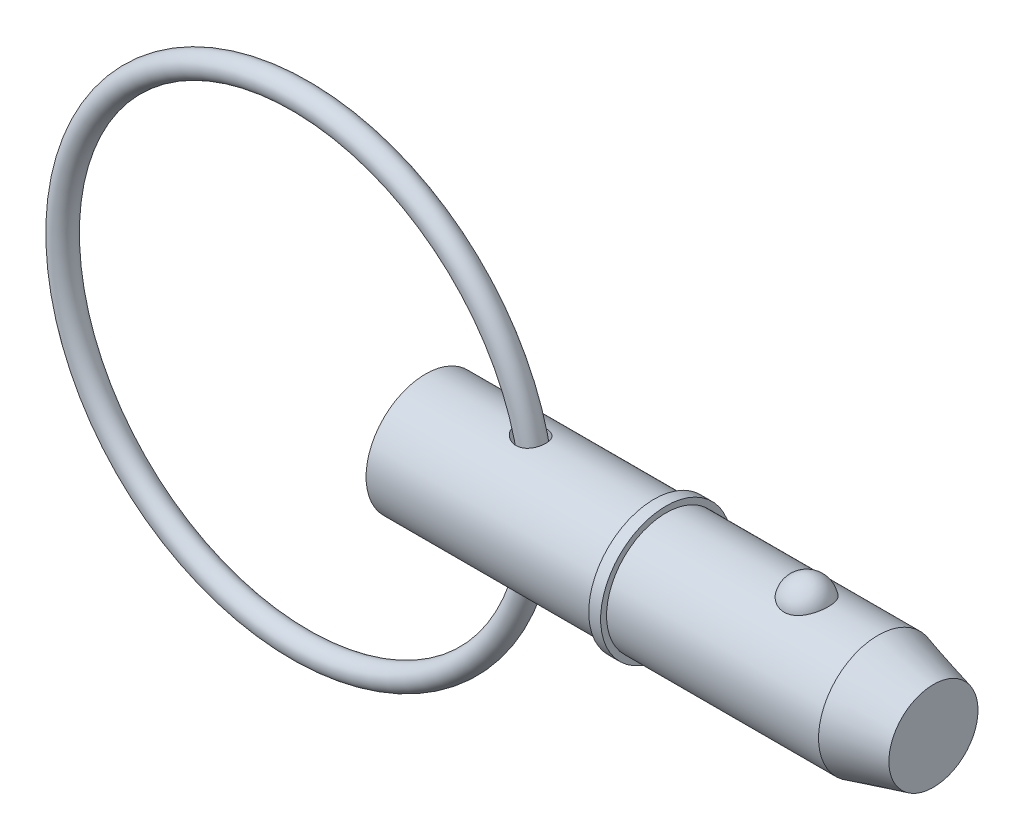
ISO-10303-21;
HEADER;
FILE_DESCRIPTION(('STEP AP214'),'2;1');
FILE_NAME('part.step','',(''),(''),'','','');
FILE_SCHEMA(('AUTOMOTIVE_DESIGN { 1 0 10303 214 1 1 1 1 }'));
ENDSEC;
DATA;
#1=APPLICATION_CONTEXT('core data for automotive mechanical design processes');
#2=APPLICATION_PROTOCOL_DEFINITION('international standard','automotive_design',2000,#1);
#3=PRODUCT_CONTEXT('',#1,'mechanical');
#4=PRODUCT('Part','Part','',(#3));
#5=PRODUCT_RELATED_PRODUCT_CATEGORY('part','',(#4));
#6=PRODUCT_DEFINITION_FORMATION('','',#4);
#7=PRODUCT_DEFINITION_CONTEXT('part definition',#1,'design');
#8=PRODUCT_DEFINITION('design','',#6,#7);
#9=PRODUCT_DEFINITION_SHAPE('','',#8);
#10=(LENGTH_UNIT() NAMED_UNIT(*) SI_UNIT(.MILLI.,.METRE.));
#11=(NAMED_UNIT(*) PLANE_ANGLE_UNIT() SI_UNIT($,.RADIAN.));
#12=(NAMED_UNIT(*) SI_UNIT($,.STERADIAN.) SOLID_ANGLE_UNIT());
#13=UNCERTAINTY_MEASURE_WITH_UNIT(LENGTH_MEASURE(1.E-05),#10,'distance_accuracy_value','');
#14=(GEOMETRIC_REPRESENTATION_CONTEXT(3) GLOBAL_UNCERTAINTY_ASSIGNED_CONTEXT((#13)) GLOBAL_UNIT_ASSIGNED_CONTEXT((#10,
#11,#12)) REPRESENTATION_CONTEXT('',''));
#15=CARTESIAN_POINT('',(0.,0.,0.));
#16=DIRECTION('',(0.,0.,1.));
#17=DIRECTION('',(1.,0.,0.));
#18=AXIS2_PLACEMENT_3D('',#15,#16,#17);
#19=CARTESIAN_POINT('',(-13.3798047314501,0.,0.));
#20=DIRECTION('',(0.,0.,1.));
#21=DIRECTION('',(1.,0.,0.));
#22=AXIS2_PLACEMENT_3D('',#19,#20,#21);
#23=TOROIDAL_SURFACE('',#22,25.4,1.27);
#24=CARTESIAN_POINT('',(13.2901952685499,0.,0.));
#25=VERTEX_POINT('',#24);
#26=VERTEX_LOOP('',#25);
#27=FACE_BOUND('',#26,.T.);
#28=ADVANCED_FACE('P0_F12',(#27),#23,.T.);
#29=CLOSED_SHELL('',(#28));
#30=MANIFOLD_SOLID_BREP('P0_B1',#29);
#31=CARTESIAN_POINT('',(0.,0.,0.));
#32=DIRECTION('',(1.,0.,0.));
#33=DIRECTION('',(0.,0.,-1.));
#34=AXIS2_PLACEMENT_3D('',#31,#32,#33);
#35=CYLINDRICAL_SURFACE('',#34,6.35);
#36=CARTESIAN_POINT('',(9.67500140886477,6.32698634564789,-0.540133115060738));
#37=CARTESIAN_POINT('',(9.70878953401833,6.3197498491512,-0.624879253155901));
#38=CARTESIAN_POINT('',(9.75028044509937,6.31105328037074,-0.706504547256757));
#39=CARTESIAN_POINT('',(9.84659255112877,6.29180070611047,-0.861319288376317));
#40=CARTESIAN_POINT('',(9.90144039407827,6.28124099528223,-0.934491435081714));
#41=CARTESIAN_POINT('',(10.021999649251,6.25949497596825,-1.0704877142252));
#42=CARTESIAN_POINT('',(10.0876589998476,6.2483118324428,-1.1333586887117));
#43=CARTESIAN_POINT('',(10.2280180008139,6.22641783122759,-1.24805262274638));
#44=CARTESIAN_POINT('',(10.3027159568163,6.21570688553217,-1.29987764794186));
#45=CARTESIAN_POINT('',(10.4650889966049,6.19509606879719,-1.39492899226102));
#46=CARTESIAN_POINT('',(10.5533142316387,6.1853135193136,-1.4372443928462));
#47=CARTESIAN_POINT('',(10.7357818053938,6.16871128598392,-1.50691441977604));
#48=CARTESIAN_POINT('',(10.8300253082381,6.16189217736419,-1.53426614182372));
#49=CARTESIAN_POINT('',(11.0227953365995,6.15211299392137,-1.57302798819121));
#50=CARTESIAN_POINT('',(11.1213511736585,6.14918579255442,-1.58430237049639));
#51=CARTESIAN_POINT('',(11.3189518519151,6.1478413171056,-1.58951619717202));
#52=CARTESIAN_POINT('',(11.417996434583,6.14942187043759,-1.58346399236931));
#53=CARTESIAN_POINT('',(11.6070859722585,6.15678569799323,-1.55457003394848));
#54=CARTESIAN_POINT('',(11.6973059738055,6.16229943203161,-1.53280404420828));
#55=CARTESIAN_POINT('',(11.8723373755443,6.176630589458,-1.4739892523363));
#56=CARTESIAN_POINT('',(11.9571502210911,6.185447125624,-1.43694455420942));
#57=CARTESIAN_POINT('',(12.1146737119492,6.20482821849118,-1.3507217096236));
#58=CARTESIAN_POINT('',(12.1877743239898,6.21528554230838,-1.30222952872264));
#59=CARTESIAN_POINT('',(12.324618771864,6.23705116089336,-1.19362916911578));
#60=CARTESIAN_POINT('',(12.3883628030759,6.24835943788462,-1.1335212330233));
#61=CARTESIAN_POINT('',(12.5046662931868,6.27053957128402,-1.00357204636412));
#62=CARTESIAN_POINT('',(12.5572571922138,6.28141258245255,-0.933759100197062));
#63=CARTESIAN_POINT('',(12.6502125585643,6.30157953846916,-0.786214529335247));
#64=CARTESIAN_POINT('',(12.6905764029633,6.31087340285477,-0.708482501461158));
#65=CARTESIAN_POINT('',(12.7585531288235,6.32699259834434,-0.546246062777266));
#66=CARTESIAN_POINT('',(12.7860022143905,6.33378599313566,-0.461669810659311));
#67=CARTESIAN_POINT('',(12.8267605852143,6.34401050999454,-0.288980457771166));
#68=CARTESIAN_POINT('',(12.8400695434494,6.34744155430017,-0.200867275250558));
#69=CARTESIAN_POINT('',(12.8522644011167,6.35058177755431,-0.0231943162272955));
#70=CARTESIAN_POINT('',(12.8510870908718,6.35027464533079,0.0663700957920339));
#71=CARTESIAN_POINT('',(12.8341831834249,6.34593169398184,0.244024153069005));
#72=CARTESIAN_POINT('',(12.8184563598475,6.341895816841,0.332113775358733));
#73=CARTESIAN_POINT('',(12.7728208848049,6.33052992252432,0.504322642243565));
#74=CARTESIAN_POINT('',(12.7429114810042,6.32319973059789,0.588441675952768));
#75=CARTESIAN_POINT('',(12.6696162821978,6.30604116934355,0.750316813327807));
#76=CARTESIAN_POINT('',(12.6262302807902,6.29621276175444,0.828072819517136));
#77=CARTESIAN_POINT('',(12.5270856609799,6.27515240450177,0.974918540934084));
#78=CARTESIAN_POINT('',(12.4713403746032,6.26392197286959,1.04401746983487));
#79=CARTESIAN_POINT('',(12.3488662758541,6.24131002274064,1.1716478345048));
#80=CARTESIAN_POINT('',(12.2821384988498,6.22992851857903,1.23018026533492));
#81=CARTESIAN_POINT('',(12.1401870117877,6.20841765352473,1.33449214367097));
#82=CARTESIAN_POINT('',(12.0650507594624,6.19827734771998,1.38038832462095));
#83=CARTESIAN_POINT('',(11.9079044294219,6.18026478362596,1.45892404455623));
#84=CARTESIAN_POINT('',(11.8258951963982,6.17239224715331,1.49156520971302));
#85=CARTESIAN_POINT('',(11.6581736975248,6.15982613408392,1.54263810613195));
#86=CARTESIAN_POINT('',(11.572502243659,6.15510409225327,1.56119728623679));
#87=CARTESIAN_POINT('',(11.3991899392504,6.14916283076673,1.58443707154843));
#88=CARTESIAN_POINT('',(11.3115488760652,6.14794399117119,1.58911617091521));
#89=CARTESIAN_POINT('',(11.1345547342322,6.14904466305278,1.58485137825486));
#90=CARTESIAN_POINT('',(11.0452104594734,6.15144894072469,1.5755811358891));
#91=CARTESIAN_POINT('',(10.8691479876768,6.15957601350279,1.54349959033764));
#92=CARTESIAN_POINT('',(10.782430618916,6.16529984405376,1.52068406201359));
#93=CARTESIAN_POINT('',(10.6082848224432,6.17983892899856,1.4605156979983));
#94=CARTESIAN_POINT('',(10.5211557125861,6.1888262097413,1.42233764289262));
#95=CARTESIAN_POINT('',(10.3542377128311,6.20874782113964,1.33268652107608));
#96=CARTESIAN_POINT('',(10.2744521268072,6.21968302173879,1.28120750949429));
#97=CARTESIAN_POINT('',(10.120854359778,6.24282707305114,1.16334748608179));
#98=CARTESIAN_POINT('',(10.0474902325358,6.25507146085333,1.09638652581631));
#99=CARTESIAN_POINT('',(9.91368693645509,6.27890019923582,0.950453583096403));
#100=CARTESIAN_POINT('',(9.85324511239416,6.29048468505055,0.87148407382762));
#101=CARTESIAN_POINT('',(9.75037543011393,6.31102161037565,0.707140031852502));
#102=CARTESIAN_POINT('',(9.70726585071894,6.32006820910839,0.622206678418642));
#103=CARTESIAN_POINT('',(9.63775895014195,6.33497125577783,0.445490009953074));
#104=CARTESIAN_POINT('',(9.61134627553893,6.34083063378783,0.35371307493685));
#105=CARTESIAN_POINT('',(9.57891955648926,6.34807071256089,0.177220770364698));
#106=CARTESIAN_POINT('',(9.5709352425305,6.3498832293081,0.0928817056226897));
#107=CARTESIAN_POINT('',(9.56994851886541,6.35010532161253,-0.0758268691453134));
#108=CARTESIAN_POINT('',(9.57692695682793,6.34851924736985,-0.160196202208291));
#109=CARTESIAN_POINT('',(9.59985709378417,6.34339435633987,-0.294043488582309));
#110=CARTESIAN_POINT('',(9.61128951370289,6.34084912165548,-0.34438537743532));
#111=CARTESIAN_POINT('',(9.63933183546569,6.33468615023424,-0.443526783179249));
#112=CARTESIAN_POINT('',(9.65594100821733,6.33106856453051,-0.492326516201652));
#113=CARTESIAN_POINT('',(9.67500140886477,6.32698634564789,-0.540133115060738));
#114=B_SPLINE_CURVE_WITH_KNOTS('',3,(#36,#37,#38,#39,#40,#41,#42,#43,#44,#45,#46,#47,#48,#49,
#50,#51,#52,#53,#54,#55,#56,#57,#58,#59,#60,#61,#62,#63,#64,#65,#66,#67,#68,#69,#70,#71,#72,#73,
#74,#75,#76,#77,#78,#79,#80,#81,#82,#83,#84,#85,#86,#87,#88,#89,#90,#91,#92,#93,#94,#95,#96,#97,
#98,#99,#100,#101,#102,#103,#104,#105,#106,#107,#108,#109,#110,#111,#112,#113),.UNSPECIFIED.,
.T.,.F.,(4,2,2,2,2,2,2,2,2,2,2,2,2,2,2,2,2,2,2,2,2,2,2,2,2,2,2,2,2,2,2,2,2,2,2,2,2,2,4),(0.,
0.274348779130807,0.54924945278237,0.822863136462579,1.09642560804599,1.3900770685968,
1.68378550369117,1.97995934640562,2.27599046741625,2.55347281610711,2.83088067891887,
3.09465189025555,3.35841759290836,3.62142956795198,3.88445494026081,4.1507318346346,
4.4170148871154,4.68446025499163,4.95190978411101,5.21937350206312,5.48684131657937,
5.75402200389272,6.02117751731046,6.28577524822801,6.55034050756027,6.81248178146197,
7.0746514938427,7.34305086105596,7.61153399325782,7.89692981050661,8.18245340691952,
8.48120635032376,8.77989784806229,9.06530254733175,9.35044442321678,9.60331609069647,
9.85586427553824,10.010650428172,10.1654147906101),.UNSPECIFIED.);
#115=CARTESIAN_POINT('',(9.67500140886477,6.32698634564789,-0.540133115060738));
#116=VERTEX_POINT('',#115);
#117=EDGE_CURVE('P1_E42',#116,#116,#114,.T.);
#118=ORIENTED_EDGE('',*,*,#117,.T.);
#119=EDGE_LOOP('',(#118));
#120=FACE_BOUND('',#119,.T.);
#121=CARTESIAN_POINT('',(0.,0.,0.));
#122=DIRECTION('',(1.,0.,0.));
#123=DIRECTION('',(0.,0.,-1.));
#124=AXIS2_PLACEMENT_3D('',#121,#122,#123);
#125=CIRCLE('',#124,6.35);
#126=CARTESIAN_POINT('',(0.,0.,-6.35));
#127=VERTEX_POINT('',#126);
#128=EDGE_CURVE('P1_E9',#127,#127,#125,.T.);
#129=ORIENTED_EDGE('',*,*,#128,.T.);
#130=EDGE_LOOP('',(#129));
#131=FACE_BOUND('',#130,.T.);
#132=CARTESIAN_POINT('',(24.43,0.,0.));
#133=DIRECTION('',(1.,0.,0.));
#134=DIRECTION('',(0.,0.,-1.));
#135=AXIS2_PLACEMENT_3D('',#132,#133,#134);
#136=CIRCLE('',#135,6.35);
#137=CARTESIAN_POINT('',(24.43,0.,-6.35));
#138=VERTEX_POINT('',#137);
#139=EDGE_CURVE('P1_E25',#138,#138,#136,.T.);
#140=ORIENTED_EDGE('',*,*,#139,.F.);
#141=EDGE_LOOP('',(#140));
#142=FACE_BOUND('',#141,.T.);
#143=CARTESIAN_POINT('',(9.67500140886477,-6.32698634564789,-0.540133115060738));
#144=CARTESIAN_POINT('',(9.64544894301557,-6.33331515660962,-0.46600258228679));
#145=CARTESIAN_POINT('',(9.62177180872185,-6.33852974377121,-0.389437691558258));
#146=CARTESIAN_POINT('',(9.58727043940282,-6.34619174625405,-0.233330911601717));
#147=CARTESIAN_POINT('',(9.57644043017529,-6.34864040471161,-0.153790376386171));
#148=CARTESIAN_POINT('',(9.56819517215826,-6.3505010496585,0.00612071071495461));
#149=CARTESIAN_POINT('',(9.57079639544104,-6.34990930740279,0.0864921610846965));
#150=CARTESIAN_POINT('',(9.58930797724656,-6.3457478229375,0.245607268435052));
#151=CARTESIAN_POINT('',(9.60522046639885,-6.34217760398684,0.324350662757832));
#152=CARTESIAN_POINT('',(9.64931570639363,-6.3324977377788,0.47727605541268));
#153=CARTESIAN_POINT('',(9.67737525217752,-6.32641361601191,0.551495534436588));
#154=CARTESIAN_POINT('',(9.74451510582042,-6.31231128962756,0.69455132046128));
#155=CARTESIAN_POINT('',(9.78359827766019,-6.30429258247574,0.763386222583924));
#156=CARTESIAN_POINT('',(9.87474700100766,-6.28638332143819,0.899414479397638));
#157=CARTESIAN_POINT('',(9.92757481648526,-6.27639669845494,0.966083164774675));
#158=CARTESIAN_POINT('',(10.042675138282,-6.25596164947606,1.09061181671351));
#159=CARTESIAN_POINT('',(10.1049521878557,-6.24551300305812,1.14846751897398));
#160=CARTESIAN_POINT('',(10.2445505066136,-6.22397505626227,1.26024641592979));
#161=CARTESIAN_POINT('',(10.3227711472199,-6.2129394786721,1.31305951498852));
#162=CARTESIAN_POINT('',(10.4867924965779,-6.19263757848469,1.40570084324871));
#163=CARTESIAN_POINT('',(10.5725962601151,-6.18337197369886,1.44552380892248));
#164=CARTESIAN_POINT('',(10.7543302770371,-6.16725983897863,1.51283687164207));
#165=CARTESIAN_POINT('',(10.8505554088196,-6.16056505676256,1.53957358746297));
#166=CARTESIAN_POINT('',(11.0463546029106,-6.15127671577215,1.57628137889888));
#167=CARTESIAN_POINT('',(11.1459276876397,-6.14868197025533,1.58625730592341));
#168=CARTESIAN_POINT('',(11.3414257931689,-6.14810798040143,1.58848000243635));
#169=CARTESIAN_POINT('',(11.4373417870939,-6.14995283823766,1.58140242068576));
#170=CARTESIAN_POINT('',(11.6262783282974,-6.1577972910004,1.55057566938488));
#171=CARTESIAN_POINT('',(11.719300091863,-6.16379511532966,1.52683360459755));
#172=CARTESIAN_POINT('',(11.8934223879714,-6.17873566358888,1.46514575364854));
#173=CARTESIAN_POINT('',(11.9749048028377,-6.18746207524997,1.42822144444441));
#174=CARTESIAN_POINT('',(12.1301362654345,-6.20693584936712,1.34105645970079));
#175=CARTESIAN_POINT('',(12.2038861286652,-6.21768299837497,1.29081719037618));
#176=CARTESIAN_POINT('',(12.3399792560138,-6.23970077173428,1.17972764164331));
#177=CARTESIAN_POINT('',(12.4025430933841,-6.25095401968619,1.11914355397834));
#178=CARTESIAN_POINT('',(12.5166805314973,-6.27296916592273,0.988307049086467));
#179=CARTESIAN_POINT('',(12.568253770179,-6.28373104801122,0.918054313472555));
#180=CARTESIAN_POINT('',(12.6596230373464,-6.3037060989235,0.769081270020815));
#181=CARTESIAN_POINT('',(12.6992956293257,-6.31290263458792,0.690283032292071));
#182=CARTESIAN_POINT('',(12.7652258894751,-6.32862394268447,0.527011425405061));
#183=CARTESIAN_POINT('',(12.7914829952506,-6.33514860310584,0.442537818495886));
#184=CARTESIAN_POINT('',(12.8301436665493,-6.34487485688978,0.269505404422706));
#185=CARTESIAN_POINT('',(12.8424230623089,-6.34804664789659,0.180917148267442));
#186=CARTESIAN_POINT('',(12.8524214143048,-6.35062347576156,0.00286829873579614));
#187=CARTESIAN_POINT('',(12.8501402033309,-6.35002846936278,-0.0865923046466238));
#188=CARTESIAN_POINT('',(12.8310619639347,-6.34513332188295,-0.263931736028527));
#189=CARTESIAN_POINT('',(12.8142517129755,-6.34082980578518,-0.35180904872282));
#190=CARTESIAN_POINT('',(12.7664911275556,-6.32897674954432,-0.523406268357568));
#191=CARTESIAN_POINT('',(12.7355404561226,-6.3214271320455,-0.607126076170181));
#192=CARTESIAN_POINT('',(12.6602298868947,-6.30390232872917,-0.768030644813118));
#193=CARTESIAN_POINT('',(12.6158695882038,-6.29392707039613,-0.845215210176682));
#194=CARTESIAN_POINT('',(12.5148171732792,-6.2726521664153,-0.990836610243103));
#195=CARTESIAN_POINT('',(12.4581254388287,-6.26135256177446,-1.05927371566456));
#196=CARTESIAN_POINT('',(12.33416419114,-6.2387572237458,-1.18510935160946));
#197=CARTESIAN_POINT('',(12.2669484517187,-6.22746174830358,-1.24256086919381));
#198=CARTESIAN_POINT('',(12.1235592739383,-6.20610255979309,-1.34519464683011));
#199=CARTESIAN_POINT('',(12.0473871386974,-6.19603866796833,-1.39037868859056));
#200=CARTESIAN_POINT('',(11.8892714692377,-6.17839642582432,-1.46678006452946));
#201=CARTESIAN_POINT('',(11.8074126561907,-6.17078838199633,-1.49816605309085));
#202=CARTESIAN_POINT('',(11.6394563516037,-6.15869606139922,-1.54712759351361));
#203=CARTESIAN_POINT('',(11.5533589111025,-6.15421174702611,-1.56470331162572));
#204=CARTESIAN_POINT('',(11.3789660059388,-6.14876652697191,-1.58596734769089));
#205=CARTESIAN_POINT('',(11.2906621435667,-6.1478222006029,-1.58959032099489));
#206=CARTESIAN_POINT('',(11.1146029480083,-6.149490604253,-1.58312110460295));
#207=CARTESIAN_POINT('',(11.0268477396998,-6.1521041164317,-1.57302589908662));
#208=CARTESIAN_POINT('',(10.8498668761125,-6.16071031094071,-1.53898332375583));
#209=CARTESIAN_POINT('',(10.7607726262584,-6.16685908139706,-1.51439468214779));
#210=CARTESIAN_POINT('',(10.5876521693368,-6.18189031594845,-1.45181305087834));
#211=CARTESIAN_POINT('',(10.5036282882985,-6.19077402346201,-1.41381396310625));
#212=CARTESIAN_POINT('',(10.3374228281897,-6.2109378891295,-1.32252480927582));
#213=CARTESIAN_POINT('',(10.255708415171,-6.2223355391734,-1.26840756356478));
#214=CARTESIAN_POINT('',(10.1025645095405,-6.24580740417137,-1.14725208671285));
#215=CARTESIAN_POINT('',(10.0311354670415,-6.25788164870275,-1.08021329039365));
#216=CARTESIAN_POINT('',(9.90472699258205,-6.2806176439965,-0.938710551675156));
#217=CARTESIAN_POINT('',(9.84904456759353,-6.29132066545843,-0.864883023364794));
#218=CARTESIAN_POINT('',(9.75129345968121,-6.31084098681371,-0.708496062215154));
#219=CARTESIAN_POINT('',(9.70921094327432,-6.31966019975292,-0.625945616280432));
#220=CARTESIAN_POINT('',(9.67500140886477,-6.32698634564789,-0.540133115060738));
#221=B_SPLINE_CURVE_WITH_KNOTS('',3,(#143,#144,#145,#146,#147,#148,#149,#150,#151,#152,#153,
#154,#155,#156,#157,#158,#159,#160,#161,#162,#163,#164,#165,#166,#167,#168,#169,#170,#171,#172,
#173,#174,#175,#176,#177,#178,#179,#180,#181,#182,#183,#184,#185,#186,#187,#188,#189,#190,#191,
#192,#193,#194,#195,#196,#197,#198,#199,#200,#201,#202,#203,#204,#205,#206,#207,#208,#209,#210,
#211,#212,#213,#214,#215,#216,#217,#218,#219,#220),.UNSPECIFIED.,.T.,.F.,(4,2,2,2,2,2,2,2,2,2,2,
2,2,2,2,2,2,2,2,2,2,2,2,2,2,2,2,2,2,2,2,2,2,2,2,2,2,2,4),(0.,0.239871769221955,
0.479635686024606,0.719693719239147,0.959790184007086,1.19750645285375,1.43528453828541,
1.69117930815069,1.94719750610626,2.23102979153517,2.51497694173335,2.81376497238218,
3.11246650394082,3.39952951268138,3.68647020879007,3.95479420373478,4.22308987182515,
4.48530700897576,4.74753278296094,5.01239119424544,5.27726070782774,5.54446524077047,
5.81167284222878,6.07912387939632,6.34658129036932,6.61404669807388,6.88150382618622,
7.1476364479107,7.41373039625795,7.67647472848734,7.93921589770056,8.20318607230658,
8.46721428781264,8.74390821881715,9.02072813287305,9.31537622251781,9.61003720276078,
9.88799314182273,10.1656654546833),.UNSPECIFIED.);
#222=CARTESIAN_POINT('',(9.67500140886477,-6.32698634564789,-0.540133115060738));
#223=VERTEX_POINT('',#222);
#224=EDGE_CURVE('P1_E17',#223,#223,#221,.T.);
#225=ORIENTED_EDGE('',*,*,#224,.T.);
#226=EDGE_LOOP('',(#225));
#227=FACE_BOUND('',#226,.T.);
#228=ADVANCED_FACE('P1_F13',(#120,#131,#142,#227),#35,.T.);
#229=CARTESIAN_POINT('',(0.,0.,0.));
#230=DIRECTION('',(1.,0.,0.));
#231=DIRECTION('',(0.,0.,-1.));
#232=AXIS2_PLACEMENT_3D('',#229,#230,#231);
#233=CYLINDRICAL_SURFACE('',#232,6.35);
#234=CARTESIAN_POINT('',(48.3553693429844,0.,0.));
#235=DIRECTION('',(1.,0.,0.));
#236=DIRECTION('',(0.,0.,-1.));
#237=AXIS2_PLACEMENT_3D('',#234,#235,#236);
#238=CIRCLE('',#237,6.35);
#239=CARTESIAN_POINT('',(48.3553693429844,0.,-6.35));
#240=VERTEX_POINT('',#239);
#241=EDGE_CURVE('P1_E99',#240,#240,#238,.T.);
#242=ORIENTED_EDGE('',*,*,#241,.F.);
#243=EDGE_LOOP('',(#242));
#244=FACE_BOUND('',#243,.T.);
#245=CARTESIAN_POINT('',(25.7,0.,0.));
#246=DIRECTION('',(1.,0.,0.));
#247=DIRECTION('',(0.,0.,-1.));
#248=AXIS2_PLACEMENT_3D('',#245,#246,#247);
#249=CIRCLE('',#248,6.35);
#250=CARTESIAN_POINT('',(25.7,0.,-6.35));
#251=VERTEX_POINT('',#250);
#252=EDGE_CURVE('P1_E96',#251,#251,#249,.T.);
#253=ORIENTED_EDGE('',*,*,#252,.T.);
#254=EDGE_LOOP('',(#253));
#255=FACE_BOUND('',#254,.T.);
#256=CARTESIAN_POINT('',(40.7300214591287,5.87502187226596,2.4096925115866));
#257=CARTESIAN_POINT('',(40.6050305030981,5.87501645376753,2.40969773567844));
#258=CARTESIAN_POINT('',(40.4800806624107,5.87916061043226,2.39967292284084));
#259=CARTESIAN_POINT('',(40.2339091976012,5.8952311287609,2.3599173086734));
#260=CARTESIAN_POINT('',(40.1126863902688,5.90715499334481,2.33019283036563));
#261=CARTESIAN_POINT('',(39.8775170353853,5.93739567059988,2.25201402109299));
#262=CARTESIAN_POINT('',(39.7635602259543,5.95570321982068,2.20358681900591));
#263=CARTESIAN_POINT('',(39.54557352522,5.99672067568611,2.08937987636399));
#264=CARTESIAN_POINT('',(39.4415457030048,6.01943149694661,2.02359652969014));
#265=CARTESIAN_POINT('',(39.2429437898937,6.06760647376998,1.87428969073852));
#266=CARTESIAN_POINT('',(39.1487268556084,6.09313095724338,1.79031110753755));
#267=CARTESIAN_POINT('',(38.9752557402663,6.14375873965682,1.60800178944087));
#268=CARTESIAN_POINT('',(38.8960043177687,6.16886196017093,1.50966841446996));
#269=CARTESIAN_POINT('',(38.7508457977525,6.21724600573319,1.29645884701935));
#270=CARTESIAN_POINT('',(38.6856885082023,6.24039621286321,1.18104158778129));
#271=CARTESIAN_POINT('',(38.5747035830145,6.28117277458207,0.940351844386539));
#272=CARTESIAN_POINT('',(38.5288776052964,6.29879865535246,0.815078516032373));
#273=CARTESIAN_POINT('',(38.4570234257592,6.32692073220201,0.556494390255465));
#274=CARTESIAN_POINT('',(38.431249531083,6.33732517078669,0.423102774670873));
#275=CARTESIAN_POINT('',(38.4009885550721,6.34957673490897,0.153542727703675));
#276=CARTESIAN_POINT('',(38.3965009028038,6.35142408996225,0.0173743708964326));
#277=CARTESIAN_POINT('',(38.4088655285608,6.34638925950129,-0.253036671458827));
#278=CARTESIAN_POINT('',(38.4255949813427,6.33955731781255,-0.387285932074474));
#279=CARTESIAN_POINT('',(38.479843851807,6.31794129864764,-0.650851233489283));
#280=CARTESIAN_POINT('',(38.5173636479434,6.30315707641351,-0.780167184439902));
#281=CARTESIAN_POINT('',(38.612500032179,6.26711642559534,-1.03041949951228));
#282=CARTESIAN_POINT('',(38.670143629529,6.24585130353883,-1.15134433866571));
#283=CARTESIAN_POINT('',(38.8043522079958,6.19905619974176,-1.38129800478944));
#284=CARTESIAN_POINT('',(38.8809187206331,6.17352587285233,-1.49032586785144));
#285=CARTESIAN_POINT('',(39.0517538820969,6.12080227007,-1.69393164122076));
#286=CARTESIAN_POINT('',(39.1461008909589,6.09360200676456,-1.78844209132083));
#287=CARTESIAN_POINT('',(39.3501196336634,6.04070434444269,-1.95970536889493));
#288=CARTESIAN_POINT('',(39.4597900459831,6.01500681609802,-2.03645972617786));
#289=CARTESIAN_POINT('',(39.6891876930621,5.96867714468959,-2.1684564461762));
#290=CARTESIAN_POINT('',(39.8086522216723,5.94794910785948,-2.2241206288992));
#291=CARTESIAN_POINT('',(40.0562188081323,5.91340580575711,-2.31440992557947));
#292=CARTESIAN_POINT('',(40.1843175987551,5.89958794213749,-2.34904294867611));
#293=CARTESIAN_POINT('',(40.438582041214,5.88111049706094,-2.39491590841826));
#294=CARTESIAN_POINT('',(40.5645207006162,5.87602512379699,-2.40724512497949));
#295=CARTESIAN_POINT('',(40.8167867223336,5.87428980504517,-2.41147867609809));
#296=CARTESIAN_POINT('',(40.943114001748,5.87763817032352,-2.40338710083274));
#297=CARTESIAN_POINT('',(41.1884170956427,5.89212921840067,-2.36762715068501));
#298=CARTESIAN_POINT('',(41.3074992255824,5.90302431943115,-2.34058030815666));
#299=CARTESIAN_POINT('',(41.5392447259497,5.93113752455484,-2.26839066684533));
#300=CARTESIAN_POINT('',(41.6519075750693,5.94835614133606,-2.2232464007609));
#301=CARTESIAN_POINT('',(41.8704009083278,5.98773016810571,-2.11493806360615));
#302=CARTESIAN_POINT('',(41.976028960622,6.00998499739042,-2.05140269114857));
#303=CARTESIAN_POINT('',(42.1753006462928,6.05690144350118,-1.90842705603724));
#304=CARTESIAN_POINT('',(42.2689415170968,6.08156361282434,-1.82898313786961));
#305=CARTESIAN_POINT('',(42.4466754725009,6.13211715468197,-1.65182429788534));
#306=CARTESIAN_POINT('',(42.5300559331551,6.15800825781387,-1.55339381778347));
#307=CARTESIAN_POINT('',(42.6797900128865,6.20712834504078,-1.34374214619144));
#308=CARTESIAN_POINT('',(42.7461405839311,6.23035685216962,-1.23251867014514));
#309=CARTESIAN_POINT('',(42.8623455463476,6.27251177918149,-0.99644720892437));
#310=CARTESIAN_POINT('',(42.9116072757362,6.29127762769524,-0.871278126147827));
#311=CARTESIAN_POINT('',(42.9896142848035,6.3215862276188,-0.6138701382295));
#312=CARTESIAN_POINT('',(43.018359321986,6.33312889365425,-0.481631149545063));
#313=CARTESIAN_POINT('',(43.0547705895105,6.34782349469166,-0.21367204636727));
#314=CARTESIAN_POINT('',(43.0624134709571,6.35096613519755,-0.0779482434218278));
#315=CARTESIAN_POINT('',(43.0563951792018,6.34851322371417,0.192943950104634));
#316=CARTESIAN_POINT('',(43.0427343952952,6.3429178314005,0.328112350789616));
#317=CARTESIAN_POINT('',(42.9945036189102,6.32360512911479,0.593406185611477));
#318=CARTESIAN_POINT('',(42.9600313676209,6.30992579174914,0.7235521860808));
#319=CARTESIAN_POINT('',(42.8709539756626,6.27586325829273,0.975834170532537));
#320=CARTESIAN_POINT('',(42.8163476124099,6.25547965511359,1.09796966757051));
#321=CARTESIAN_POINT('',(42.6877587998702,6.20998183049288,1.33148921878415));
#322=CARTESIAN_POINT('',(42.6136742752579,6.18484288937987,1.44281227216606));
#323=CARTESIAN_POINT('',(42.4478204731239,6.13258735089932,1.65087683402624));
#324=CARTESIAN_POINT('',(42.3560515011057,6.10547078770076,1.74761859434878));
#325=CARTESIAN_POINT('',(42.1571839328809,6.0523587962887,1.92350926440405));
#326=CARTESIAN_POINT('',(42.050133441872,6.0263601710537,2.00271146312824));
#327=CARTESIAN_POINT('',(41.8231384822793,5.97843747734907,2.14154159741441));
#328=CARTESIAN_POINT('',(41.703191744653,5.95651412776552,2.20116608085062));
#329=CARTESIAN_POINT('',(41.4445236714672,5.91812106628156,2.30250570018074));
#330=CARTESIAN_POINT('',(41.3050698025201,5.90217533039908,2.34256795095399));
#331=CARTESIAN_POINT('',(41.0203974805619,5.88063128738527,2.39615214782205));
#332=CARTESIAN_POINT('',(40.8751817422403,5.8750281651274,2.40968644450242));
#333=CARTESIAN_POINT('',(40.7300214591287,5.87502187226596,2.4096925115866));
#334=B_SPLINE_CURVE_WITH_KNOTS('',3,(#256,#257,#258,#259,#260,#261,#262,#263,#264,#265,#266,
#267,#268,#269,#270,#271,#272,#273,#274,#275,#276,#277,#278,#279,#280,#281,#282,#283,#284,#285,
#286,#287,#288,#289,#290,#291,#292,#293,#294,#295,#296,#297,#298,#299,#300,#301,#302,#303,#304,
#305,#306,#307,#308,#309,#310,#311,#312,#313,#314,#315,#316,#317,#318,#319,#320,#321,#322,#323,
#324,#325,#326,#327,#328,#329,#330,#331,#332,#333),.UNSPECIFIED.,.T.,.F.,(4,2,2,2,2,2,2,2,2,2,2,
2,2,2,2,2,2,2,2,2,2,2,2,2,2,2,2,2,2,2,2,2,2,2,2,2,2,2,4),(0.,0.374440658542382,0.74876119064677,
1.12254078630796,1.49639810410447,1.88098871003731,2.26565013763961,2.6674110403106,
3.06920639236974,3.47601794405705,3.88281858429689,4.28727498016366,4.69173873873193,
5.09674745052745,5.50178895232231,5.90865911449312,6.31549420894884,6.71369855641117,
7.11175305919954,7.48978077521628,7.86773278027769,8.23383886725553,8.5999746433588,
8.97409044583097,9.34829231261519,9.74122667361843,10.1342313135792,10.5397522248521,
10.9452779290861,11.3512521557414,11.7572189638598,12.1612938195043,12.5653932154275,
12.9716540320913,13.3779078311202,13.7829098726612,14.1879832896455,14.6230486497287,
15.0579114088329),.UNSPECIFIED.);
#335=CARTESIAN_POINT('',(40.7300214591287,5.87502187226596,2.4096925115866));
#336=VERTEX_POINT('',#335);
#337=EDGE_CURVE('P1_E34',#336,#336,#334,.T.);
#338=ORIENTED_EDGE('',*,*,#337,.T.);
#339=EDGE_LOOP('',(#338));
#340=FACE_BOUND('',#339,.T.);
#341=ADVANCED_FACE('P1_F46',(#244,#255,#340),#233,.T.);
#342=CARTESIAN_POINT('',(0.,0.,0.));
#343=DIRECTION('',(-1.,0.,0.));
#344=DIRECTION('',(0.,0.,1.));
#345=AXIS2_PLACEMENT_3D('',#342,#343,#344);
#346=PLANE('',#345);
#347=ORIENTED_EDGE('',*,*,#128,.F.);
#348=EDGE_LOOP('',(#347));
#349=FACE_BOUND('',#348,.T.);
#350=ADVANCED_FACE('P1_F15',(#349),#346,.T.);
#351=CARTESIAN_POINT('',(24.43,6.35,0.));
#352=DIRECTION('',(-1.,0.,0.));
#353=DIRECTION('',(0.,0.,1.));
#354=AXIS2_PLACEMENT_3D('',#351,#352,#353);
#355=PLANE('',#354);
#356=ORIENTED_EDGE('',*,*,#139,.T.);
#357=EDGE_LOOP('',(#356));
#358=FACE_BOUND('',#357,.T.);
#359=CARTESIAN_POINT('',(24.43,0.,0.));
#360=DIRECTION('',(1.,0.,0.));
#361=DIRECTION('',(0.,0.,-1.));
#362=AXIS2_PLACEMENT_3D('',#359,#360,#361);
#363=CIRCLE('',#362,6.985);
#364=CARTESIAN_POINT('',(24.43,0.,-6.985));
#365=VERTEX_POINT('',#364);
#366=EDGE_CURVE('P1_E30',#365,#365,#363,.T.);
#367=ORIENTED_EDGE('',*,*,#366,.F.);
#368=EDGE_LOOP('',(#367));
#369=FACE_BOUND('',#368,.T.);
#370=ADVANCED_FACE('P1_F81',(#358,#369),#355,.T.);
#371=CARTESIAN_POINT('',(0.,0.,0.));
#372=DIRECTION('',(1.,0.,0.));
#373=DIRECTION('',(0.,0.,-1.));
#374=AXIS2_PLACEMENT_3D('',#371,#372,#373);
#375=CYLINDRICAL_SURFACE('',#374,6.985);
#376=ORIENTED_EDGE('',*,*,#366,.T.);
#377=EDGE_LOOP('',(#376));
#378=FACE_BOUND('',#377,.T.);
#379=CARTESIAN_POINT('',(25.7,0.,0.));
#380=DIRECTION('',(1.,0.,0.));
#381=DIRECTION('',(0.,0.,-1.));
#382=AXIS2_PLACEMENT_3D('',#379,#380,#381);
#383=CIRCLE('',#382,6.985);
#384=CARTESIAN_POINT('',(25.7,0.,-6.985));
#385=VERTEX_POINT('',#384);
#386=EDGE_CURVE('P1_E95',#385,#385,#383,.T.);
#387=ORIENTED_EDGE('',*,*,#386,.F.);
#388=EDGE_LOOP('',(#387));
#389=FACE_BOUND('',#388,.T.);
#390=ADVANCED_FACE('P1_F68',(#378,#389),#375,.T.);
#391=CARTESIAN_POINT('',(25.7,6.985,0.));
#392=DIRECTION('',(1.,0.,0.));
#393=DIRECTION('',(0.,0.,-1.));
#394=AXIS2_PLACEMENT_3D('',#391,#392,#393);
#395=PLANE('',#394);
#396=ORIENTED_EDGE('',*,*,#386,.T.);
#397=EDGE_LOOP('',(#396));
#398=FACE_BOUND('',#397,.T.);
#399=ORIENTED_EDGE('',*,*,#252,.F.);
#400=EDGE_LOOP('',(#399));
#401=FACE_BOUND('',#400,.T.);
#402=ADVANCED_FACE('P1_F62',(#398,#401),#395,.T.);
#403=CARTESIAN_POINT('',(54.28,0.,0.));
#404=DIRECTION('',(-1.,0.,0.));
#405=DIRECTION('',(0.,0.,1.));
#406=AXIS2_PLACEMENT_3D('',#403,#404,#405);
#407=CONICAL_SURFACE('',#406,4.76250000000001,0.26179938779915);
#408=ORIENTED_EDGE('',*,*,#241,.T.);
#409=EDGE_LOOP('',(#408));
#410=FACE_BOUND('',#409,.T.);
#411=CARTESIAN_POINT('',(54.28,0.,0.));
#412=DIRECTION('',(1.,0.,0.));
#413=DIRECTION('',(0.,0.,-1.));
#414=AXIS2_PLACEMENT_3D('',#411,#412,#413);
#415=CIRCLE('',#414,4.76250000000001);
#416=CARTESIAN_POINT('',(54.28,0.,-4.76250000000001));
#417=VERTEX_POINT('',#416);
#418=EDGE_CURVE('P1_E41',#417,#417,#415,.T.);
#419=ORIENTED_EDGE('',*,*,#418,.F.);
#420=EDGE_LOOP('',(#419));
#421=FACE_BOUND('',#420,.T.);
#422=ADVANCED_FACE('P1_F59',(#410,#421),#407,.T.);
#423=CARTESIAN_POINT('',(54.28,4.76250000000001,0.));
#424=DIRECTION('',(1.,0.,0.));
#425=DIRECTION('',(0.,0.,-1.));
#426=AXIS2_PLACEMENT_3D('',#423,#424,#425);
#427=PLANE('',#426);
#428=ORIENTED_EDGE('',*,*,#418,.T.);
#429=EDGE_LOOP('',(#428));
#430=FACE_BOUND('',#429,.T.);
#431=ADVANCED_FACE('P1_F55',(#430),#427,.T.);
#432=CARTESIAN_POINT('',(40.7300214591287,5.71499999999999,0.));
#433=DIRECTION('',(-1.,0.,0.));
#434=DIRECTION('',(0.,1.,0.));
#435=AXIS2_PLACEMENT_3D('',#432,#433,#434);
#436=SPHERICAL_SURFACE('',#435,2.41500000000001);
#437=ORIENTED_EDGE('',*,*,#337,.F.);
#438=EDGE_LOOP('',(#437));
#439=FACE_BOUND('',#438,.T.);
#440=ADVANCED_FACE('P1_F50',(#439),#436,.T.);
#441=CARTESIAN_POINT('',(-13.3798047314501,0.,0.));
#442=DIRECTION('',(0.,0.,1.));
#443=DIRECTION('',(1.,0.,0.));
#444=AXIS2_PLACEMENT_3D('',#441,#442,#443);
#445=TOROIDAL_SURFACE('',#444,25.4,1.5875);
#446=ORIENTED_EDGE('',*,*,#224,.F.);
#447=EDGE_LOOP('',(#446));
#448=FACE_BOUND('',#447,.T.);
#449=ORIENTED_EDGE('',*,*,#117,.F.);
#450=EDGE_LOOP('',(#449));
#451=FACE_BOUND('',#450,.T.);
#452=ADVANCED_FACE('P1_F54',(#448,#451),#445,.F.);
#453=CLOSED_SHELL('',(#228,#341,#350,#370,#390,#402,#422,#431,#440,#452));
#454=MANIFOLD_SOLID_BREP('P1_B1',#453);
#455=ADVANCED_BREP_SHAPE_REPRESENTATION('',(#18,#30,#454),#14);
#456=SHAPE_DEFINITION_REPRESENTATION(#9,#455);
ENDSEC;
END-ISO-10303-21;
